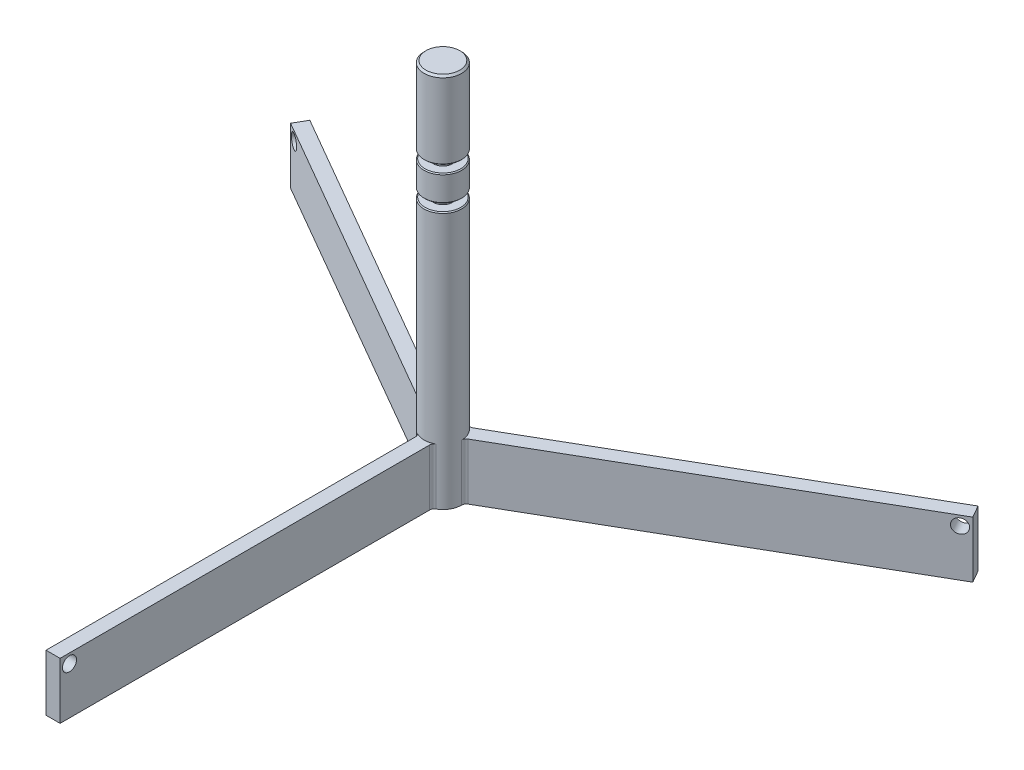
from build123d import *

# Parameters (mm, degrees)
SKETCH6_W                = 9.525
SKETCH6_H                = 38.1
BOSS_EXTRUDE2_DEPTH      = 263.525
SKETCH7_R                = 4.7625
CUT_EXTRUDE2_DEPTH       = 367.423749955
FILLET2_R                = 3.175
CIRPATTERN2_COUNT        = 3
FILLET2_OF_CIRPATTERN2_R = 3.175
CHAMFER5_SIZE            = 0.635
CHAMFER6_SIZE            = 1.27


with BuildPart() as part:
    # Sketch5 → Base-Revolve (revolve)
    with BuildSketch(Plane.XY, mode=Mode.PRIVATE) as base_revolve_sk:
        Polygon((12.7, 173.99), (6.35, 173.99), (6.35, 179.07), (12.7, 179.07), (12.7, 196.596), (6.35, 196.596), (6.35, 201.676), (12.7, 201.676), (12.7, 254), (0, 254), (0, 0), (12.7, 0), align=None)
    revolve(base_revolve_sk.sketch.rotate(Axis((0, 112.385522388, 0), (0, -1, 0)), 90), axis=Axis((0, 112.385522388, 0), (0, -1, 0)))

    # Sketch6 → Boss-Extrude2 (add)
    with BuildSketch(Plane.XY):
        with Locations((0, 19.05)):
            Rectangle(SKETCH6_W, SKETCH6_H)
    boss_extrude2 = extrude(amount=BOSS_EXTRUDE2_DEPTH)

    # Sketch7 → Cut-Extrude2 (cut, through all)
    with BuildSketch(Plane(origin=(4.7625, 0, 0), x_dir=(0, 0, -1), z_dir=(1, 0, 0))):
        with Locations(Location((-257.175, 31.75, 0), (0, 0, 90))):
            Circle(SKETCH7_R)
    cut_extrude2 = extrude(amount=-CUT_EXTRUDE2_DEPTH, mode=Mode.SUBTRACT)

    # Fillet2
    fillet2_edges = [part.edges().sort_by_distance(p)[0] for p in [
        (-4.7625, 19.05, 11.773215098),
        (4.7625, 19.05, 11.773215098),
    ]]
    fillet(fillet2_edges, radius=FILLET2_R)

    # CirPattern2: Boss-Extrude2, Cut-Extrude2 ×3 about axis
    cirpattern2_axis = Axis((0, 0, 0), (0, 1, 0))
    add([boss_extrude2.rotate(cirpattern2_axis, i * 360 / CIRPATTERN2_COUNT) for i in range(1, CIRPATTERN2_COUNT)])
    add([cut_extrude2.rotate(cirpattern2_axis, i * 360 / CIRPATTERN2_COUNT) for i in range(1, CIRPATTERN2_COUNT)], mode=Mode.SUBTRACT)

    # Fillet2 of CirPattern2
    fillet2_of_cirpattern2_edges = [part.edges().sort_by_distance(p)[0] for p in [
        (12.577153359, 19.05, -1.762161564),
        (7.814653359, 19.05, -10.011053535),
        (-7.814653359, 19.05, -10.011053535),
        (-12.577153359, 19.05, -1.762161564),
    ]]
    fillet(fillet2_of_cirpattern2_edges, radius=FILLET2_OF_CIRPATTERN2_R)

    # Chamfer5
    chamfer5_edges = [part.edges().sort_by_distance(p)[0] for p in [
        (0, 201.676, -12.7),
        (0, 173.99, -12.7),
        (0, 179.07, -12.7),
        (0, 196.596, -12.7),
    ]]
    chamfer(chamfer5_edges, length=CHAMFER5_SIZE)

    # Chamfer6
    chamfer6_edges = [part.edges().sort_by_distance(p)[0] for p in [
        (0, 254, -12.7),
    ]]
    chamfer(chamfer6_edges, length=CHAMFER6_SIZE)


solid = part.part
